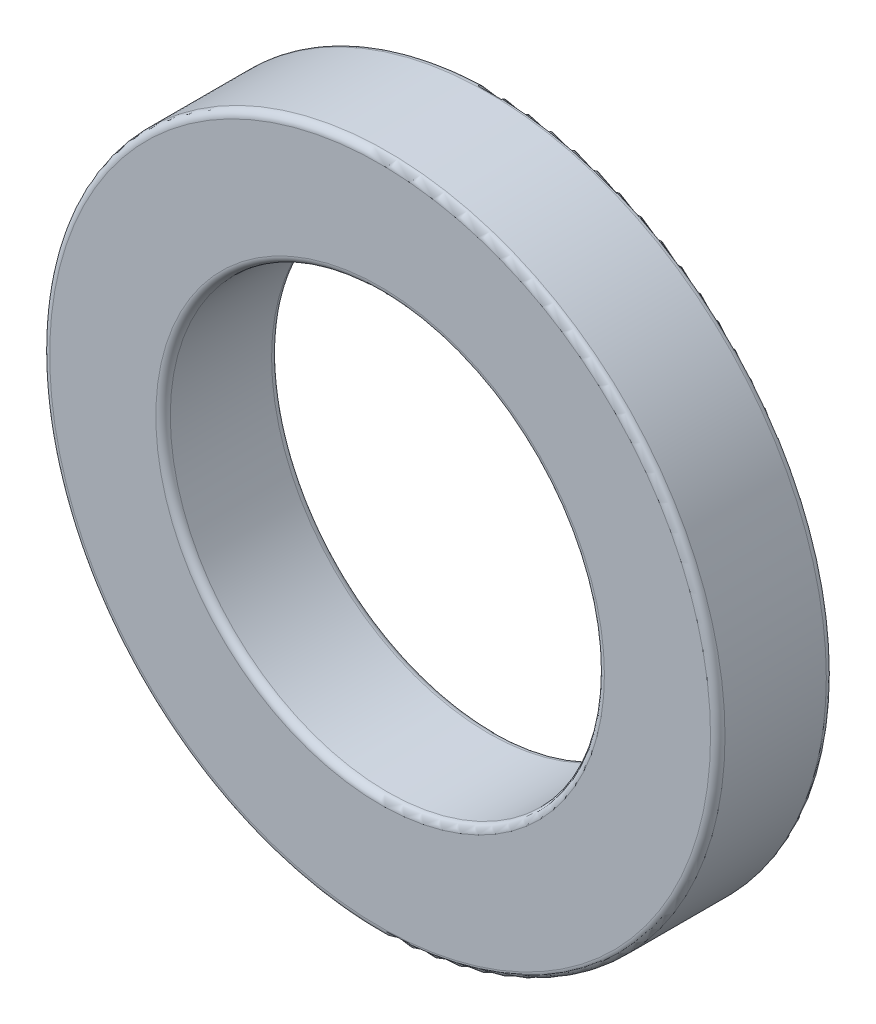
ISO-10303-21;
HEADER;
FILE_DESCRIPTION(('STEP AP214'),'2;1');
FILE_NAME('part.step','',(''),(''),'','','');
FILE_SCHEMA(('AUTOMOTIVE_DESIGN { 1 0 10303 214 1 1 1 1 }'));
ENDSEC;
DATA;
#1=APPLICATION_CONTEXT('core data for automotive mechanical design processes');
#2=APPLICATION_PROTOCOL_DEFINITION('international standard','automotive_design',2000,#1);
#3=PRODUCT_CONTEXT('',#1,'mechanical');
#4=PRODUCT('Part','Part','',(#3));
#5=PRODUCT_RELATED_PRODUCT_CATEGORY('part','',(#4));
#6=PRODUCT_DEFINITION_FORMATION('','',#4);
#7=PRODUCT_DEFINITION_CONTEXT('part definition',#1,'design');
#8=PRODUCT_DEFINITION('design','',#6,#7);
#9=PRODUCT_DEFINITION_SHAPE('','',#8);
#10=(LENGTH_UNIT() NAMED_UNIT(*) SI_UNIT(.MILLI.,.METRE.));
#11=(NAMED_UNIT(*) PLANE_ANGLE_UNIT() SI_UNIT($,.RADIAN.));
#12=(NAMED_UNIT(*) SI_UNIT($,.STERADIAN.) SOLID_ANGLE_UNIT());
#13=UNCERTAINTY_MEASURE_WITH_UNIT(LENGTH_MEASURE(1.E-05),#10,'distance_accuracy_value','');
#14=(GEOMETRIC_REPRESENTATION_CONTEXT(3) GLOBAL_UNCERTAINTY_ASSIGNED_CONTEXT((#13)) GLOBAL_UNIT_ASSIGNED_CONTEXT((#10,
#11,#12)) REPRESENTATION_CONTEXT('',''));
#15=CARTESIAN_POINT('',(0.,0.,0.));
#16=DIRECTION('',(0.,0.,1.));
#17=DIRECTION('',(1.,0.,0.));
#18=AXIS2_PLACEMENT_3D('',#15,#16,#17);
#19=CARTESIAN_POINT('',(0.,0.,-1.5));
#20=DIRECTION('',(0.,0.,1.));
#21=DIRECTION('',(1.,0.,0.));
#22=AXIS2_PLACEMENT_3D('',#19,#20,#21);
#23=TOROIDAL_SURFACE('',#22,68.5,1.5);
#24=CARTESIAN_POINT('',(0.,0.,-1.5));
#25=DIRECTION('',(0.,0.,1.));
#26=DIRECTION('',(1.,0.,0.));
#27=AXIS2_PLACEMENT_3D('',#24,#25,#26);
#28=CIRCLE('',#27,70.);
#29=CARTESIAN_POINT('',(70.,0.,-1.5));
#30=VERTEX_POINT('',#29);
#31=EDGE_CURVE('E10',#30,#30,#28,.T.);
#32=ORIENTED_EDGE('',*,*,#31,.T.);
#33=EDGE_LOOP('',(#32));
#34=FACE_BOUND('',#33,.T.);
#35=CARTESIAN_POINT('',(0.,0.,0.));
#36=DIRECTION('',(0.,0.,1.));
#37=DIRECTION('',(1.,0.,0.));
#38=AXIS2_PLACEMENT_3D('',#35,#36,#37);
#39=CIRCLE('',#38,68.5);
#40=CARTESIAN_POINT('',(68.5,0.,0.));
#41=VERTEX_POINT('',#40);
#42=EDGE_CURVE('E59',#41,#41,#39,.T.);
#43=ORIENTED_EDGE('',*,*,#42,.F.);
#44=EDGE_LOOP('',(#43));
#45=FACE_BOUND('',#44,.T.);
#46=ADVANCED_FACE('F31',(#34,#45),#23,.T.);
#47=CARTESIAN_POINT('',(0.,0.,33.1757165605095));
#48=DIRECTION('',(0.,0.,1.));
#49=DIRECTION('',(1.,0.,0.));
#50=AXIS2_PLACEMENT_3D('',#47,#48,#49);
#51=CYLINDRICAL_SURFACE('',#50,70.);
#52=CARTESIAN_POINT('',(0.,0.,-22.5));
#53=DIRECTION('',(0.,0.,1.));
#54=DIRECTION('',(1.,0.,0.));
#55=AXIS2_PLACEMENT_3D('',#52,#53,#54);
#56=CIRCLE('',#55,70.);
#57=CARTESIAN_POINT('',(70.,0.,-22.5));
#58=VERTEX_POINT('',#57);
#59=EDGE_CURVE('E37',#58,#58,#56,.T.);
#60=ORIENTED_EDGE('',*,*,#59,.T.);
#61=EDGE_LOOP('',(#60));
#62=FACE_BOUND('',#61,.T.);
#63=ORIENTED_EDGE('',*,*,#31,.F.);
#64=EDGE_LOOP('',(#63));
#65=FACE_BOUND('',#64,.T.);
#66=ADVANCED_FACE('F161',(#62,#65),#51,.T.);
#67=CARTESIAN_POINT('',(0.,0.,-22.5));
#68=DIRECTION('',(0.,0.,1.));
#69=DIRECTION('',(1.,0.,0.));
#70=AXIS2_PLACEMENT_3D('',#67,#68,#69);
#71=TOROIDAL_SURFACE('',#70,68.5,1.5);
#72=ORIENTED_EDGE('',*,*,#59,.F.);
#73=EDGE_LOOP('',(#72));
#74=FACE_BOUND('',#73,.T.);
#75=CARTESIAN_POINT('',(0.,0.,-24.));
#76=DIRECTION('',(0.,0.,1.));
#77=DIRECTION('',(1.,0.,0.));
#78=AXIS2_PLACEMENT_3D('',#75,#76,#77);
#79=CIRCLE('',#78,68.5);
#80=CARTESIAN_POINT('',(68.5,0.,-24.));
#81=VERTEX_POINT('',#80);
#82=EDGE_CURVE('E41',#81,#81,#79,.T.);
#83=ORIENTED_EDGE('',*,*,#82,.T.);
#84=EDGE_LOOP('',(#83));
#85=FACE_BOUND('',#84,.T.);
#86=ADVANCED_FACE('F158',(#74,#85),#71,.T.);
#87=CARTESIAN_POINT('',(0.,68.5,-24.));
#88=DIRECTION('',(0.,0.,-1.));
#89=DIRECTION('',(-1.,0.,0.));
#90=AXIS2_PLACEMENT_3D('',#87,#88,#89);
#91=PLANE('',#90);
#92=CARTESIAN_POINT('',(0.,0.,-24.));
#93=DIRECTION('',(0.,0.,1.));
#94=DIRECTION('',(1.,0.,0.));
#95=AXIS2_PLACEMENT_3D('',#92,#93,#94);
#96=CIRCLE('',#95,46.5);
#97=CARTESIAN_POINT('',(46.5,0.,-24.));
#98=VERTEX_POINT('',#97);
#99=EDGE_CURVE('E45',#98,#98,#96,.T.);
#100=ORIENTED_EDGE('',*,*,#99,.T.);
#101=EDGE_LOOP('',(#100));
#102=FACE_BOUND('',#101,.T.);
#103=ORIENTED_EDGE('',*,*,#82,.F.);
#104=EDGE_LOOP('',(#103));
#105=FACE_BOUND('',#104,.T.);
#106=ADVANCED_FACE('F154',(#102,#105),#91,.T.);
#107=CARTESIAN_POINT('',(0.,0.,-22.5));
#108=DIRECTION('',(0.,0.,1.));
#109=DIRECTION('',(1.,0.,0.));
#110=AXIS2_PLACEMENT_3D('',#107,#108,#109);
#111=TOROIDAL_SURFACE('',#110,46.5,1.5);
#112=CARTESIAN_POINT('',(0.,0.,-22.5));
#113=DIRECTION('',(0.,0.,1.));
#114=DIRECTION('',(1.,0.,0.));
#115=AXIS2_PLACEMENT_3D('',#112,#113,#114);
#116=CIRCLE('',#115,45.);
#117=CARTESIAN_POINT('',(45.,0.,-22.5));
#118=VERTEX_POINT('',#117);
#119=EDGE_CURVE('E50',#118,#118,#116,.T.);
#120=ORIENTED_EDGE('',*,*,#119,.T.);
#121=EDGE_LOOP('',(#120));
#122=FACE_BOUND('',#121,.T.);
#123=ORIENTED_EDGE('',*,*,#99,.F.);
#124=EDGE_LOOP('',(#123));
#125=FACE_BOUND('',#124,.T.);
#126=ADVANCED_FACE('F150',(#122,#125),#111,.T.);
#127=CARTESIAN_POINT('',(0.,0.,33.1757165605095));
#128=DIRECTION('',(0.,0.,1.));
#129=DIRECTION('',(1.,0.,0.));
#130=AXIS2_PLACEMENT_3D('',#127,#128,#129);
#131=CYLINDRICAL_SURFACE('',#130,45.);
#132=CARTESIAN_POINT('',(0.,0.,-1.5));
#133=DIRECTION('',(0.,0.,1.));
#134=DIRECTION('',(1.,0.,0.));
#135=AXIS2_PLACEMENT_3D('',#132,#133,#134);
#136=CIRCLE('',#135,45.);
#137=CARTESIAN_POINT('',(45.,0.,-1.5));
#138=VERTEX_POINT('',#137);
#139=EDGE_CURVE('E53',#138,#138,#136,.T.);
#140=ORIENTED_EDGE('',*,*,#139,.T.);
#141=EDGE_LOOP('',(#140));
#142=FACE_BOUND('',#141,.T.);
#143=ORIENTED_EDGE('',*,*,#119,.F.);
#144=EDGE_LOOP('',(#143));
#145=FACE_BOUND('',#144,.T.);
#146=ADVANCED_FACE('F146',(#142,#145),#131,.F.);
#147=CARTESIAN_POINT('',(0.,0.,-1.5));
#148=DIRECTION('',(0.,0.,1.));
#149=DIRECTION('',(1.,0.,0.));
#150=AXIS2_PLACEMENT_3D('',#147,#148,#149);
#151=TOROIDAL_SURFACE('',#150,46.5,1.5);
#152=CARTESIAN_POINT('',(0.,0.,0.));
#153=DIRECTION('',(0.,0.,1.));
#154=DIRECTION('',(1.,0.,0.));
#155=AXIS2_PLACEMENT_3D('',#152,#153,#154);
#156=CIRCLE('',#155,46.5);
#157=CARTESIAN_POINT('',(46.5,0.,0.));
#158=VERTEX_POINT('',#157);
#159=EDGE_CURVE('E56',#158,#158,#156,.T.);
#160=ORIENTED_EDGE('',*,*,#159,.T.);
#161=EDGE_LOOP('',(#160));
#162=FACE_BOUND('',#161,.T.);
#163=ORIENTED_EDGE('',*,*,#139,.F.);
#164=EDGE_LOOP('',(#163));
#165=FACE_BOUND('',#164,.T.);
#166=ADVANCED_FACE('F142',(#162,#165),#151,.T.);
#167=CARTESIAN_POINT('',(0.,46.5,0.));
#168=DIRECTION('',(0.,0.,1.));
#169=DIRECTION('',(1.,0.,0.));
#170=AXIS2_PLACEMENT_3D('',#167,#168,#169);
#171=PLANE('',#170);
#172=ORIENTED_EDGE('',*,*,#42,.T.);
#173=EDGE_LOOP('',(#172));
#174=FACE_BOUND('',#173,.T.);
#175=ORIENTED_EDGE('',*,*,#159,.F.);
#176=EDGE_LOOP('',(#175));
#177=FACE_BOUND('',#176,.T.);
#178=ADVANCED_FACE('F140',(#174,#177),#171,.T.);
#179=CLOSED_SHELL('',(#46,#66,#86,#106,#126,#146,#166,#178));
#180=CARTESIAN_POINT('',(0.,63.75,-11.985));
#181=DIRECTION('',(0.,0.,1.));
#182=DIRECTION('',(1.,0.,0.));
#183=AXIS2_PLACEMENT_3D('',#180,#181,#182);
#184=PLANE('',#183);
#185=CARTESIAN_POINT('',(0.,0.,-11.985));
#186=DIRECTION('',(0.,0.,1.));
#187=DIRECTION('',(1.,0.,0.));
#188=AXIS2_PLACEMENT_3D('',#185,#186,#187);
#189=CIRCLE('',#188,63.76);
#190=CARTESIAN_POINT('',(63.76,0.,-11.985));
#191=VERTEX_POINT('',#190);
#192=EDGE_CURVE('E62',#191,#191,#189,.T.);
#193=ORIENTED_EDGE('',*,*,#192,.F.);
#194=EDGE_LOOP('',(#193));
#195=FACE_BOUND('',#194,.T.);
#196=CARTESIAN_POINT('',(0.,0.,-11.985));
#197=DIRECTION('',(0.,0.,1.));
#198=DIRECTION('',(1.,0.,0.));
#199=AXIS2_PLACEMENT_3D('',#196,#197,#198);
#200=CIRCLE('',#199,57.515);
#201=CARTESIAN_POINT('',(57.515,0.,-11.985));
#202=VERTEX_POINT('',#201);
#203=EDGE_CURVE('E95',#202,#202,#200,.T.);
#204=ORIENTED_EDGE('',*,*,#203,.T.);
#205=EDGE_LOOP('',(#204));
#206=FACE_BOUND('',#205,.T.);
#207=ADVANCED_FACE('F99',(#195,#206),#184,.F.);
#208=CARTESIAN_POINT('',(0.,0.,8.31184503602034));
#209=DIRECTION('',(0.,0.,1.));
#210=DIRECTION('',(1.,0.,0.));
#211=AXIS2_PLACEMENT_3D('',#208,#209,#210);
#212=CYLINDRICAL_SURFACE('',#211,63.76);
#213=CARTESIAN_POINT('',(0.,0.,-12.015));
#214=DIRECTION('',(0.,0.,1.));
#215=DIRECTION('',(1.,0.,0.));
#216=AXIS2_PLACEMENT_3D('',#213,#214,#215);
#217=CIRCLE('',#216,63.76);
#218=CARTESIAN_POINT('',(63.76,0.,-12.015));
#219=VERTEX_POINT('',#218);
#220=EDGE_CURVE('E65',#219,#219,#217,.T.);
#221=ORIENTED_EDGE('',*,*,#220,.F.);
#222=EDGE_LOOP('',(#221));
#223=FACE_BOUND('',#222,.T.);
#224=ORIENTED_EDGE('',*,*,#192,.T.);
#225=EDGE_LOOP('',(#224));
#226=FACE_BOUND('',#225,.T.);
#227=ADVANCED_FACE('F127',(#223,#226),#212,.F.);
#228=CARTESIAN_POINT('',(0.,63.75,-12.015));
#229=DIRECTION('',(0.,0.,1.));
#230=DIRECTION('',(1.,0.,0.));
#231=AXIS2_PLACEMENT_3D('',#228,#229,#230);
#232=PLANE('',#231);
#233=ORIENTED_EDGE('',*,*,#220,.T.);
#234=EDGE_LOOP('',(#233));
#235=FACE_BOUND('',#234,.T.);
#236=CARTESIAN_POINT('',(0.,0.,-12.015));
#237=DIRECTION('',(0.,0.,1.));
#238=DIRECTION('',(1.,0.,0.));
#239=AXIS2_PLACEMENT_3D('',#236,#237,#238);
#240=CIRCLE('',#239,57.515);
#241=CARTESIAN_POINT('',(57.515,0.,-12.015));
#242=VERTEX_POINT('',#241);
#243=EDGE_CURVE('E68',#242,#242,#240,.T.);
#244=ORIENTED_EDGE('',*,*,#243,.F.);
#245=EDGE_LOOP('',(#244));
#246=FACE_BOUND('',#245,.T.);
#247=ADVANCED_FACE('F134',(#235,#246),#232,.T.);
#248=CARTESIAN_POINT('',(0.,0.,8.31184503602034));
#249=DIRECTION('',(0.,0.,1.));
#250=DIRECTION('',(1.,0.,0.));
#251=AXIS2_PLACEMENT_3D('',#248,#249,#250);
#252=CYLINDRICAL_SURFACE('',#251,57.515);
#253=ORIENTED_EDGE('',*,*,#243,.T.);
#254=EDGE_LOOP('',(#253));
#255=FACE_BOUND('',#254,.T.);
#256=CARTESIAN_POINT('',(0.,0.,-21.61));
#257=DIRECTION('',(0.,0.,1.));
#258=DIRECTION('',(1.,0.,0.));
#259=AXIS2_PLACEMENT_3D('',#256,#257,#258);
#260=CIRCLE('',#259,57.515);
#261=CARTESIAN_POINT('',(57.515,0.,-21.61));
#262=VERTEX_POINT('',#261);
#263=EDGE_CURVE('E71',#262,#262,#260,.T.);
#264=ORIENTED_EDGE('',*,*,#263,.F.);
#265=EDGE_LOOP('',(#264));
#266=FACE_BOUND('',#265,.T.);
#267=ADVANCED_FACE('F242',(#255,#266),#252,.F.);
#268=CARTESIAN_POINT('',(0.,63.75,-21.61));
#269=DIRECTION('',(0.,0.,1.));
#270=DIRECTION('',(1.,0.,0.));
#271=AXIS2_PLACEMENT_3D('',#268,#269,#270);
#272=PLANE('',#271);
#273=ORIENTED_EDGE('',*,*,#263,.T.);
#274=EDGE_LOOP('',(#273));
#275=FACE_BOUND('',#274,.T.);
#276=CARTESIAN_POINT('',(0.,0.,-21.61));
#277=DIRECTION('',(0.,0.,1.));
#278=DIRECTION('',(1.,0.,0.));
#279=AXIS2_PLACEMENT_3D('',#276,#277,#278);
#280=CIRCLE('',#279,57.485);
#281=CARTESIAN_POINT('',(57.485,0.,-21.61));
#282=VERTEX_POINT('',#281);
#283=EDGE_CURVE('E74',#282,#282,#280,.T.);
#284=ORIENTED_EDGE('',*,*,#283,.F.);
#285=EDGE_LOOP('',(#284));
#286=FACE_BOUND('',#285,.T.);
#287=ADVANCED_FACE('F251',(#275,#286),#272,.T.);
#288=CARTESIAN_POINT('',(0.,0.,8.31184503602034));
#289=DIRECTION('',(0.,0.,1.));
#290=DIRECTION('',(1.,0.,0.));
#291=AXIS2_PLACEMENT_3D('',#288,#289,#290);
#292=CYLINDRICAL_SURFACE('',#291,57.485);
#293=CARTESIAN_POINT('',(0.,0.,-12.015));
#294=DIRECTION('',(0.,0.,1.));
#295=DIRECTION('',(1.,0.,0.));
#296=AXIS2_PLACEMENT_3D('',#293,#294,#295);
#297=CIRCLE('',#296,57.485);
#298=CARTESIAN_POINT('',(57.485,0.,-12.015));
#299=VERTEX_POINT('',#298);
#300=EDGE_CURVE('E77',#299,#299,#297,.T.);
#301=ORIENTED_EDGE('',*,*,#300,.F.);
#302=EDGE_LOOP('',(#301));
#303=FACE_BOUND('',#302,.T.);
#304=ORIENTED_EDGE('',*,*,#283,.T.);
#305=EDGE_LOOP('',(#304));
#306=FACE_BOUND('',#305,.T.);
#307=ADVANCED_FACE('F261',(#303,#306),#292,.T.);
#308=CARTESIAN_POINT('',(0.,63.75,-12.015));
#309=DIRECTION('',(0.,0.,-1.));
#310=DIRECTION('',(-1.,0.,0.));
#311=AXIS2_PLACEMENT_3D('',#308,#309,#310);
#312=PLANE('',#311);
#313=CARTESIAN_POINT('',(0.,0.,-12.015));
#314=DIRECTION('',(0.,0.,1.));
#315=DIRECTION('',(1.,0.,0.));
#316=AXIS2_PLACEMENT_3D('',#313,#314,#315);
#317=CIRCLE('',#316,51.24);
#318=CARTESIAN_POINT('',(51.24,0.,-12.015));
#319=VERTEX_POINT('',#318);
#320=EDGE_CURVE('E80',#319,#319,#317,.T.);
#321=ORIENTED_EDGE('',*,*,#320,.F.);
#322=EDGE_LOOP('',(#321));
#323=FACE_BOUND('',#322,.T.);
#324=ORIENTED_EDGE('',*,*,#300,.T.);
#325=EDGE_LOOP('',(#324));
#326=FACE_BOUND('',#325,.T.);
#327=ADVANCED_FACE('F271',(#323,#326),#312,.F.);
#328=CARTESIAN_POINT('',(0.,0.,8.31184503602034));
#329=DIRECTION('',(0.,0.,1.));
#330=DIRECTION('',(1.,0.,0.));
#331=AXIS2_PLACEMENT_3D('',#328,#329,#330);
#332=CYLINDRICAL_SURFACE('',#331,51.24);
#333=ORIENTED_EDGE('',*,*,#320,.T.);
#334=EDGE_LOOP('',(#333));
#335=FACE_BOUND('',#334,.T.);
#336=CARTESIAN_POINT('',(0.,0.,-11.985));
#337=DIRECTION('',(0.,0.,1.));
#338=DIRECTION('',(1.,0.,0.));
#339=AXIS2_PLACEMENT_3D('',#336,#337,#338);
#340=CIRCLE('',#339,51.24);
#341=CARTESIAN_POINT('',(51.24,0.,-11.985));
#342=VERTEX_POINT('',#341);
#343=EDGE_CURVE('E83',#342,#342,#340,.T.);
#344=ORIENTED_EDGE('',*,*,#343,.F.);
#345=EDGE_LOOP('',(#344));
#346=FACE_BOUND('',#345,.T.);
#347=ADVANCED_FACE('F122',(#335,#346),#332,.T.);
#348=CARTESIAN_POINT('',(0.,63.75,-11.985));
#349=DIRECTION('',(0.,0.,-1.));
#350=DIRECTION('',(-1.,0.,0.));
#351=AXIS2_PLACEMENT_3D('',#348,#349,#350);
#352=PLANE('',#351);
#353=ORIENTED_EDGE('',*,*,#343,.T.);
#354=EDGE_LOOP('',(#353));
#355=FACE_BOUND('',#354,.T.);
#356=CARTESIAN_POINT('',(0.,0.,-11.985));
#357=DIRECTION('',(0.,0.,1.));
#358=DIRECTION('',(1.,0.,0.));
#359=AXIS2_PLACEMENT_3D('',#356,#357,#358);
#360=CIRCLE('',#359,57.485);
#361=CARTESIAN_POINT('',(57.485,0.,-11.985));
#362=VERTEX_POINT('',#361);
#363=EDGE_CURVE('E86',#362,#362,#360,.T.);
#364=ORIENTED_EDGE('',*,*,#363,.F.);
#365=EDGE_LOOP('',(#364));
#366=FACE_BOUND('',#365,.T.);
#367=ADVANCED_FACE('F116',(#355,#366),#352,.T.);
#368=CARTESIAN_POINT('',(0.,0.,8.31184503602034));
#369=DIRECTION('',(0.,0.,1.));
#370=DIRECTION('',(1.,0.,0.));
#371=AXIS2_PLACEMENT_3D('',#368,#369,#370);
#372=CYLINDRICAL_SURFACE('',#371,57.485);
#373=ORIENTED_EDGE('',*,*,#363,.T.);
#374=EDGE_LOOP('',(#373));
#375=FACE_BOUND('',#374,.T.);
#376=CARTESIAN_POINT('',(0.,0.,-2.38999999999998));
#377=DIRECTION('',(0.,0.,1.));
#378=DIRECTION('',(1.,0.,0.));
#379=AXIS2_PLACEMENT_3D('',#376,#377,#378);
#380=CIRCLE('',#379,57.485);
#381=CARTESIAN_POINT('',(57.485,0.,-2.38999999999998));
#382=VERTEX_POINT('',#381);
#383=EDGE_CURVE('E89',#382,#382,#380,.T.);
#384=ORIENTED_EDGE('',*,*,#383,.F.);
#385=EDGE_LOOP('',(#384));
#386=FACE_BOUND('',#385,.T.);
#387=ADVANCED_FACE('F111',(#375,#386),#372,.T.);
#388=CARTESIAN_POINT('',(0.,63.75,-2.38999999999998));
#389=DIRECTION('',(0.,0.,1.));
#390=DIRECTION('',(1.,0.,0.));
#391=AXIS2_PLACEMENT_3D('',#388,#389,#390);
#392=PLANE('',#391);
#393=CARTESIAN_POINT('',(0.,0.,-2.38999999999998));
#394=DIRECTION('',(0.,0.,1.));
#395=DIRECTION('',(1.,0.,0.));
#396=AXIS2_PLACEMENT_3D('',#393,#394,#395);
#397=CIRCLE('',#396,57.515);
#398=CARTESIAN_POINT('',(57.515,0.,-2.38999999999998));
#399=VERTEX_POINT('',#398);
#400=EDGE_CURVE('E92',#399,#399,#397,.T.);
#401=ORIENTED_EDGE('',*,*,#400,.F.);
#402=EDGE_LOOP('',(#401));
#403=FACE_BOUND('',#402,.T.);
#404=ORIENTED_EDGE('',*,*,#383,.T.);
#405=EDGE_LOOP('',(#404));
#406=FACE_BOUND('',#405,.T.);
#407=ADVANCED_FACE('F104',(#403,#406),#392,.F.);
#408=CARTESIAN_POINT('',(0.,0.,8.31184503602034));
#409=DIRECTION('',(0.,0.,1.));
#410=DIRECTION('',(1.,0.,0.));
#411=AXIS2_PLACEMENT_3D('',#408,#409,#410);
#412=CYLINDRICAL_SURFACE('',#411,57.515);
#413=ORIENTED_EDGE('',*,*,#203,.F.);
#414=EDGE_LOOP('',(#413));
#415=FACE_BOUND('',#414,.T.);
#416=ORIENTED_EDGE('',*,*,#400,.T.);
#417=EDGE_LOOP('',(#416));
#418=FACE_BOUND('',#417,.T.);
#419=ADVANCED_FACE('F101',(#415,#418),#412,.F.);
#420=CLOSED_SHELL('',(#207,#227,#247,#267,#287,#307,#327,#347,#367,#387,#407,#419));
#421=ORIENTED_CLOSED_SHELL('',*,#420,.T.);
#422=BREP_WITH_VOIDS('B2',#179,(#421));
#423=ADVANCED_BREP_SHAPE_REPRESENTATION('',(#18,#422),#14);
#424=SHAPE_DEFINITION_REPRESENTATION(#9,#423);
ENDSEC;
END-ISO-10303-21;
